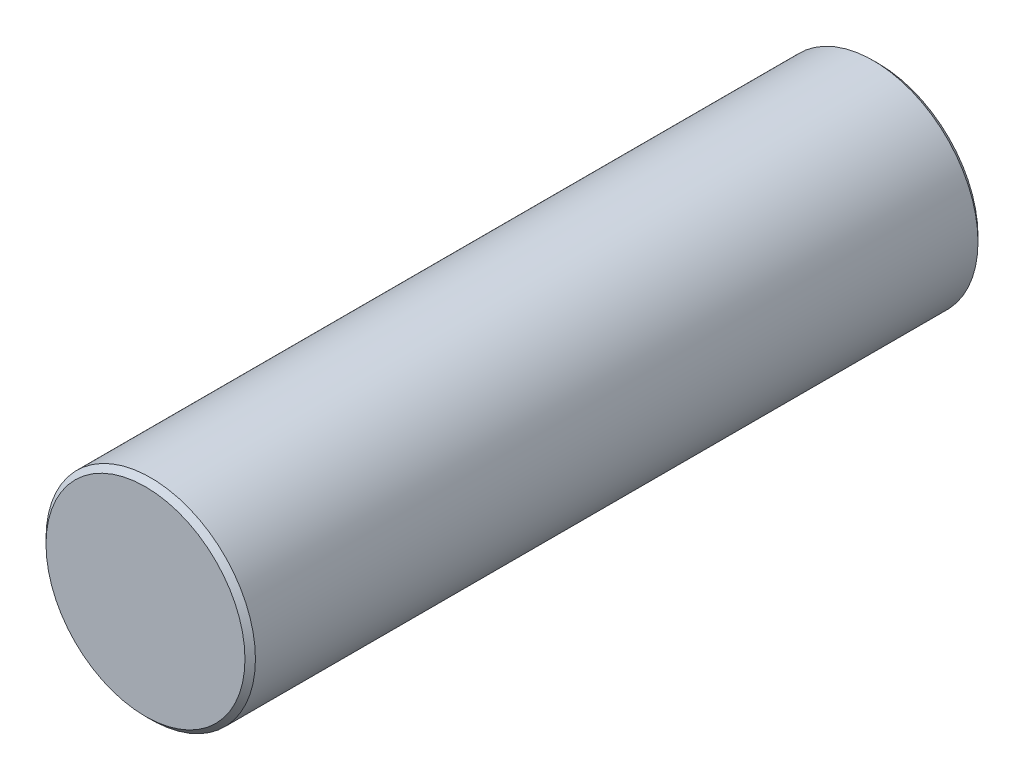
from build123d import *

# Parameters (mm, degrees)
ESQUISSE1_R          = 2
BASE_EXTRUSION_DEPTH = 14
CHANFREIN1_SIZE      = 0.1


with BuildPart() as part:
    # Esquisse1 → Base-Extrusion (new body)
    with BuildSketch(Plane.XY):
        Circle(ESQUISSE1_R)
    extrude(amount=-BASE_EXTRUSION_DEPTH)

    # Chanfrein1
    chanfrein1_edges = [part.edges().sort_by_distance(p)[0] for p in [
        (-2, 0, 0),
        (-2, 0, -14),
    ]]
    chamfer(chanfrein1_edges, length=CHANFREIN1_SIZE)


solid = part.part
